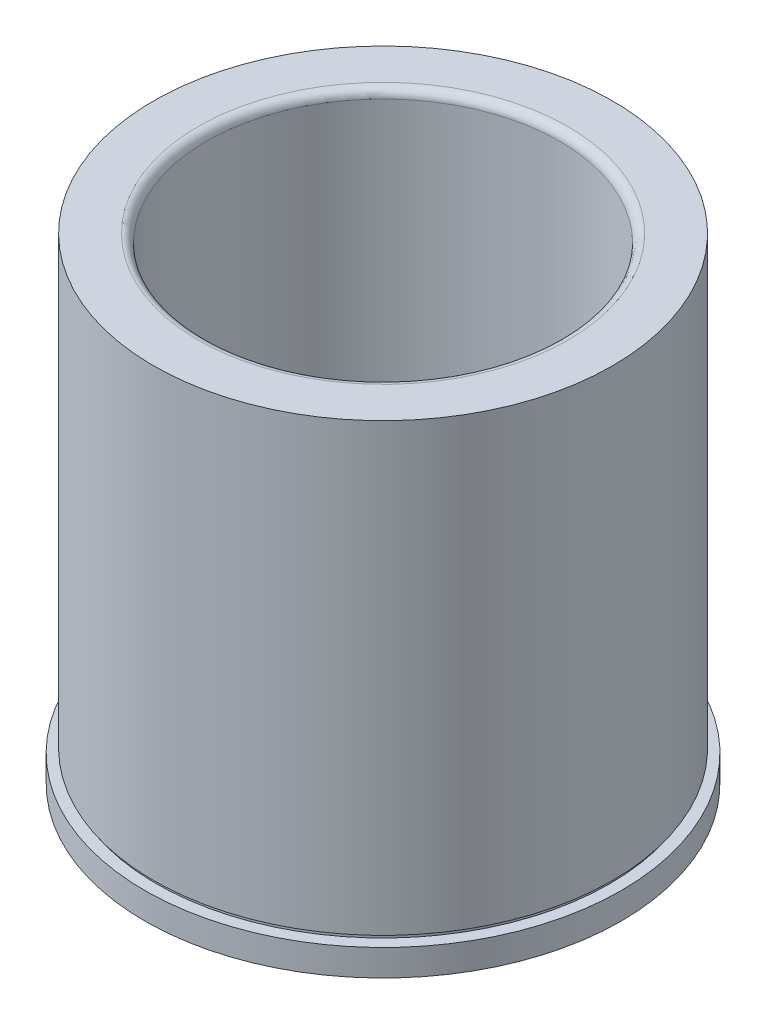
from build123d import *

# Parameters (mm, degrees)
FILLET1_R = 1.524


with BuildPart() as part:
    # Sketch1 → Revolve1 (revolve)
    with BuildSketch(Plane.XY, mode=Mode.PRIVATE) as revolve1_sk:
        Polygon((-31.75635, 101.650690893), (-31.75635, 16.741746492), (-32.572405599, 15.925690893), (-42.8625, 15.925690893), (-42.8625, 20.688190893), (-40.77335, 20.688190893), (-40.77335, 21.450190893), (-41.28135, 21.450190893), (-41.28135, 101.650690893), align=None)
    revolve(revolve1_sk.sketch.rotate(Axis((0, -1000, 0), (0, 1, 0)), 180), axis=Axis((0, -1000, 0), (0, 1, 0)))

    # Fillet1
    fillet1_edges = [part.edges().sort_by_distance(p)[0] for p in [
        (-31.75635, 101.650690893, 0),
    ]]
    fillet(fillet1_edges, radius=FILLET1_R)


solid = part.part
